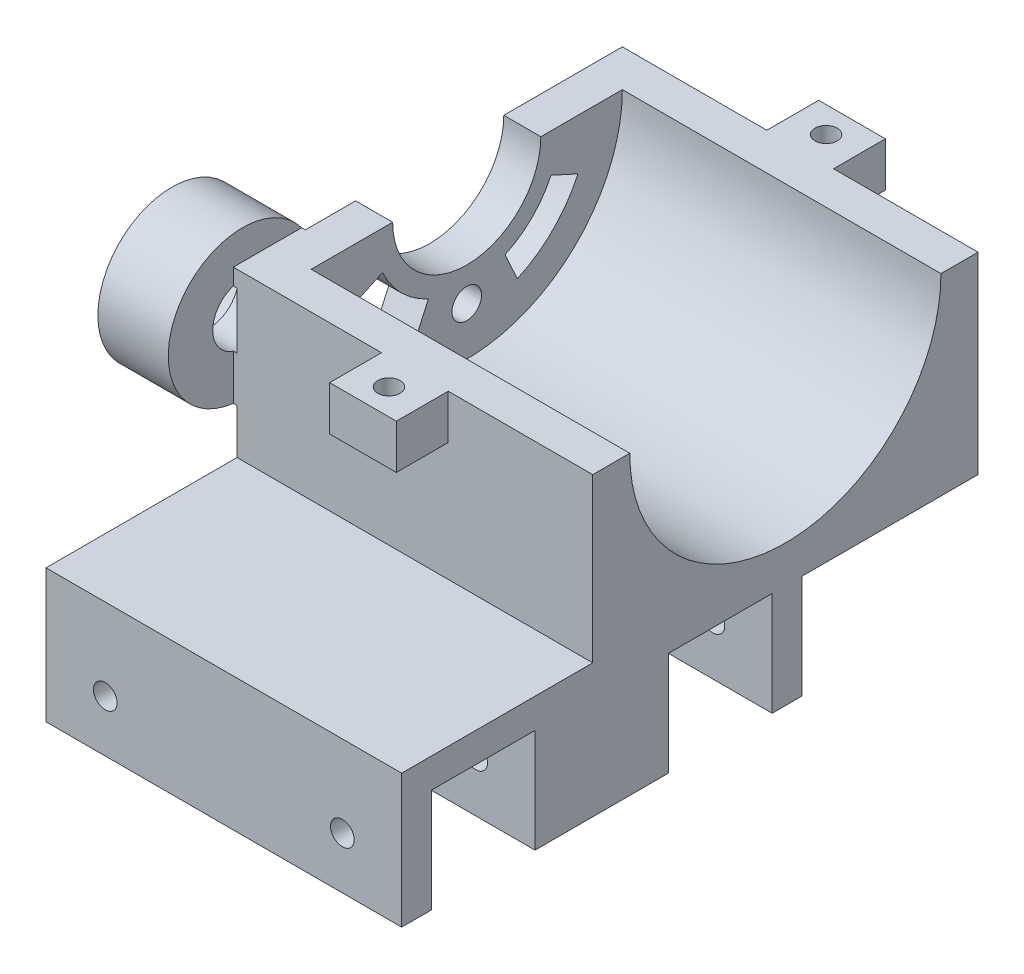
from build123d import *

# Parameters (mm, degrees)
SKETCH_1_W          = 48
SKETCH_1_H          = 52
EXTRUDE_1_DEPTH     = 26
CUT_EXTRUDE_1_DEPTH = 43
SKETCH_3_R          = 10
CUT_EXTRUDE_2_DEPTH = 72.220307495
CUT_EXTRUDE_START   = -5
SKETCH_3_3_R        = 2
CUT_EXTRUDE_3_DEPTH = 5
SKETCH_4_W          = 9
SKETCH_4_H          = 7
SKETCH_4_R          = 1.5
EXTRUDE_2_DEPTH     = 6
CUT_EXTRUDE_START_2 = -2.5
SKETCH_5_R          = 1.5
CUT_EXTRUDE_4_DEPTH = 2.5
SKETCH_6_R          = 10
EXTRUDE_3_DEPTH     = 10
SKETCH_7_R          = 7
CUT_EXTRUDE_5_DEPTH = 5
SKETCH_7_3_R        = 4
CUT_EXTRUDE_6_DEPTH = 10
CUT_EXTRUDE_7_DEPTH = 0.5
SKETCH_9_W          = 4
SKETCH_9_H          = 14
EXTRUDE_4_DEPTH     = 48
SKETCH_10_W         = 9
SKETCH_10_H         = 12
CUT_EXTRUDE_8_DEPTH = 14
CUT_EXTRUDE_9_REACH = 74.277
SKETCH_11_R         = 1.6


with BuildPart() as part:
    # Sketch 1 → Extrude 1 (new body)
    with BuildSketch(Plane(origin=(0, 0, 0), x_dir=(1, 0, 0), z_dir=(0, 1, 0))):
        with Locations((-3.522349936, -19.74201788)):
            Rectangle(SKETCH_1_W, SKETCH_1_H)
    extrude(amount=EXTRUDE_1_DEPTH)

    # Sketch 2 → Cut-Extrude 1 (cut)
    with BuildSketch(Plane(origin=(20.477650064, 0, 0), x_dir=(0, 0, -1), z_dir=(1, 0, 0))):
        with BuildLine():
            Line((1.25798212, 26), (-19.74201788, 26))
            Line((-19.74201788, 26), (-19.74201788, 5))
            ThreePointArc((-19.74201788, 5), (-4.892775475, 11.150757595), (1.25798212, 26))
        make_face()
        with BuildLine():
            Line((-40.74201788, 26), (-19.74201788, 26))
            Line((-19.74201788, 26), (1.25798212, 26))
            ThreePointArc((1.25798212, 26), (-19.74201788, 47), (-40.74201788, 26))
        make_face()
        with BuildLine():
            Line((-19.74201788, 5), (-19.74201788, 26))
            Line((-19.74201788, 26), (-40.74201788, 26))
            ThreePointArc((-40.74201788, 26), (-34.591260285, 11.150757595), (-19.74201788, 5))
        make_face()
        with BuildLine():
            Line((1.25798212, 26), (-19.74201788, 26))
            Line((-19.74201788, 26), (-19.74201788, 5))
            ThreePointArc((-19.74201788, 5), (-4.892775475, 11.150757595), (1.25798212, 26))
        make_face()
        with BuildLine():
            Line((-40.74201788, 26), (-19.74201788, 26))
            Line((-19.74201788, 26), (1.25798212, 26))
            ThreePointArc((1.25798212, 26), (-19.74201788, 47), (-40.74201788, 26))
        make_face()
        with BuildLine():
            Line((-19.74201788, 5), (-19.74201788, 26))
            Line((-19.74201788, 26), (-40.74201788, 26))
            ThreePointArc((-40.74201788, 26), (-34.591260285, 11.150757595), (-19.74201788, 5))
        make_face()
    extrude(amount=-CUT_EXTRUDE_1_DEPTH, mode=Mode.SUBTRACT)

    # Sketch 3 → Cut-Extrude 2 (cut, through all)
    with BuildSketch(Plane.ZY.offset(27.522349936)):
        with Locations((19.74201788, 26)):
            Circle(SKETCH_3_R)
    extrude(amount=-CUT_EXTRUDE_2_DEPTH, mode=Mode.SUBTRACT)

    # Sketch 3_3 → Cut-Extrude 3 (cut)
    with BuildSketch(Plane.ZY.offset(27.522349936).offset(CUT_EXTRUDE_START)):
        with BuildLine():
            ThreePointArc((14.569604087, 14.620363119), (10.911928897, 17.152428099), (8.372634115, 20.805087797))
            Line((8.372634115, 20.805087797), (4.73443131, 19.142715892))
            ThreePointArc((4.73443131, 19.142715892), (8.086300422, 14.32120509), (12.914431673, 10.978879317))
            Line((12.914431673, 10.978879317), (14.569604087, 14.620363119))
        make_face()
        with BuildLine():
            ThreePointArc((31.111401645, 20.805087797), (28.572106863, 17.152428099), (24.914431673, 14.620363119))
            Line((24.914431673, 14.620363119), (26.569604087, 10.978879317))
            ThreePointArc((26.569604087, 10.978879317), (31.397735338, 14.32120509), (34.74960445, 19.142715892))
            Line((34.74960445, 19.142715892), (31.111401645, 20.805087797))
        make_face()
        with Locations((19.74201788, 11.5)):
            Circle(SKETCH_3_3_R)
    extrude(amount=CUT_EXTRUDE_3_DEPTH, mode=Mode.SUBTRACT)

    # Sketch 4 → Extrude 2 (add)
    # profile 1 of 2: a face of its own
    with BuildSketch(Plane(origin=(0, 26, 0), x_dir=(1, 0, 0), z_dir=(0, 1, 0))):
        with Locations((-3.522349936, 9.75798212)):
            Rectangle(SKETCH_4_W, SKETCH_4_H)
        with Locations(Location((-3.522349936, 9.75798212, 0), (0, 0, 270))):
            Circle(SKETCH_4_R, mode=Mode.SUBTRACT)
    # profile 2 of 2: a face of its own
    with BuildSketch(Plane(origin=(0, 26, 0), x_dir=(1, 0, 0), z_dir=(0, 1, 0))):
        with Locations((-3.522349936, -49.24201788)):
            Rectangle(SKETCH_4_W, SKETCH_4_H)
        with Locations(Location((-3.522349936, -49.24201788, 0), (0, 0, 270))):
            Circle(SKETCH_4_R, mode=Mode.SUBTRACT)
    extrude(amount=-EXTRUDE_2_DEPTH)

    # Sketch 5 → Cut-Extrude 4 (cut)
    # profile 1 of 2: a face of its own
    with BuildSketch(Plane.XZ.offset(-20).offset(CUT_EXTRUDE_START_2)):
        Polygon((-6.322349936, 51.082679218), (-3.522349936, 52.29201788), (-0.722349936, 51.082679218), (-0.722349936, 47.401356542), (-3.522349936, 46.19201788), (-6.322349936, 47.401356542), align=None)
        with Locations(Location((-3.522349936, 49.24201788, 0), (0, 0, 90))):
            Circle(SKETCH_5_R, mode=Mode.SUBTRACT)
    # profile 2 of 2: a face of its own
    with BuildSketch(Plane.XZ.offset(-20).offset(CUT_EXTRUDE_START_2)):
        Polygon((-6.322349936, -7.917320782), (-3.522349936, -6.70798212), (-0.722349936, -7.917320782), (-0.722349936, -11.598643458), (-3.522349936, -12.80798212), (-6.322349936, -11.598643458), align=None)
        with Locations(Location((-3.522349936, -9.75798212, 0), (0, 0, 90))):
            Circle(SKETCH_5_R, mode=Mode.SUBTRACT)
    extrude(amount=CUT_EXTRUDE_4_DEPTH, mode=Mode.SUBTRACT)

    # Sketch 6 → Extrude 3 (add)
    with BuildSketch(Plane.ZY.offset(27.522349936)):
        with Locations(Location((44.526085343, 20, 0), (0, 0, 184.408516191))):
            Circle(SKETCH_6_R)
    extrude(amount=EXTRUDE_3_DEPTH)

    # Sketch 7 → Cut-Extrude 5 (cut)
    with BuildSketch(Plane.ZY.offset(37.522349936)):
        with Locations((44.526085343, 20)):
            Circle(SKETCH_7_R)
    extrude(amount=-CUT_EXTRUDE_5_DEPTH, mode=Mode.SUBTRACT)

    # Sketch 7_3 → Cut-Extrude 6 (cut)
    with BuildSketch(Plane.ZY.offset(37.522349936)):
        with Locations((44.526085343, 20)):
            Circle(SKETCH_7_3_R)
    extrude(amount=-CUT_EXTRUDE_6_DEPTH, mode=Mode.SUBTRACT)

    # Sketch 8 → Cut-Extrude 7 (cut)
    with BuildSketch(Plane(origin=(-27.522349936, 0, 0), x_dir=(0, 0, -1), z_dir=(1, 0, 0))):
        with BuildLine():
            Line((-45.74201788, 10.074199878), (-45.74201788, 16.189290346))
            ThreePointArc((-45.74201788, 16.189290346), (-48.526085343, 20), (-45.74201788, 23.810709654))
            Line((-45.74201788, 23.810709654), (-45.74201788, 26))
            Line((-45.74201788, 26), (-36.526085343, 26))
            ThreePointArc((-36.526085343, 26), (-53.181353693, 25.008625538), (-45.74201788, 10.074199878))
        make_face()
    extrude(amount=-CUT_EXTRUDE_7_DEPTH, mode=Mode.SUBTRACT)

    # Sketch 9 → Extrude 4 (add)
    with BuildSketch(Plane(origin=(20.477650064, 0, 0), x_dir=(0, 0, -1), z_dir=(1, 0, 0))):
        Polygon((-45.74201788, 4), (-71.526085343, 4), (-71.526085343, -14), (-67.526085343, -14), (-67.526085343, 0), (-53.526085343, 0), (-53.526085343, -14), (-35.526085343, -14), (-35.526085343, 0), (-45.74201788, 0), align=None)
        with Locations((-19.526085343, -7)):
            Rectangle(SKETCH_9_W, SKETCH_9_H)
    extrude(amount=-EXTRUDE_4_DEPTH)

    # Sketch 10 → Cut-Extrude 8 (cut)
    with BuildSketch(Plane.XZ.offset(14)):
        with Locations((-9.022349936, 44.526085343)):
            Rectangle(SKETCH_10_W, SKETCH_10_H)
        with Locations((-20.022349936, 44.526085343)):
            Rectangle(SKETCH_10_W, SKETCH_10_H)
        with Locations((1.977650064, 44.526085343)):
            Rectangle(SKETCH_10_W, SKETCH_10_H)
        with Locations((12.977650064, 44.526085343)):
            Rectangle(SKETCH_10_W, SKETCH_10_H)
    extrude(amount=-CUT_EXTRUDE_8_DEPTH, mode=Mode.SUBTRACT)

    # Cut-Extrude 9: up to this face of the body (flat: up to its plane)
    cut_extrude_9_end = Plane(part.part.faces().sort_by_distance((-3.522349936, -5, 71.526085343))[0])
    # Sketch 11 → Cut-Extrude 9 (cut, up to the picked face)
    with BuildSketch(Plane(origin=(0, 0, 17.526085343), x_dir=(-1, 0, 0), z_dir=(0, 0, -1)), mode=Mode.PRIVATE) as cut_extrude_9_sk1:
        with Locations((19.522349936, -7)):
            Circle(SKETCH_11_R)
    cut_extrude_9_tool1 = split(extrude(cut_extrude_9_sk1.sketch, amount=-CUT_EXTRUDE_9_REACH, mode=Mode.PRIVATE), bisect_by=cut_extrude_9_end, keep=Keep.BOTH, mode=Mode.PRIVATE)
    # Sketch 11 → Cut-Extrude 9 (cut, up to the picked face)
    with BuildSketch(Plane(origin=(0, 0, 17.526085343), x_dir=(-1, 0, 0), z_dir=(0, 0, -1)), mode=Mode.PRIVATE) as cut_extrude_9_sk2:
        with Locations((-12.477650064, -7)):
            Circle(SKETCH_11_R)
    cut_extrude_9_tool2 = split(extrude(cut_extrude_9_sk2.sketch, amount=-CUT_EXTRUDE_9_REACH, mode=Mode.PRIVATE), bisect_by=cut_extrude_9_end, keep=Keep.BOTH, mode=Mode.PRIVATE)
    add(cut_extrude_9_tool1.solids().sort_by(Axis((-19.52235, -7, 17.526085), (0, 0, 1)))[0], mode=Mode.SUBTRACT)
    add(cut_extrude_9_tool2.solids().sort_by(Axis((12.47765, -7, 17.526085), (0, 0, 1)))[0], mode=Mode.SUBTRACT)


solid = part.part
